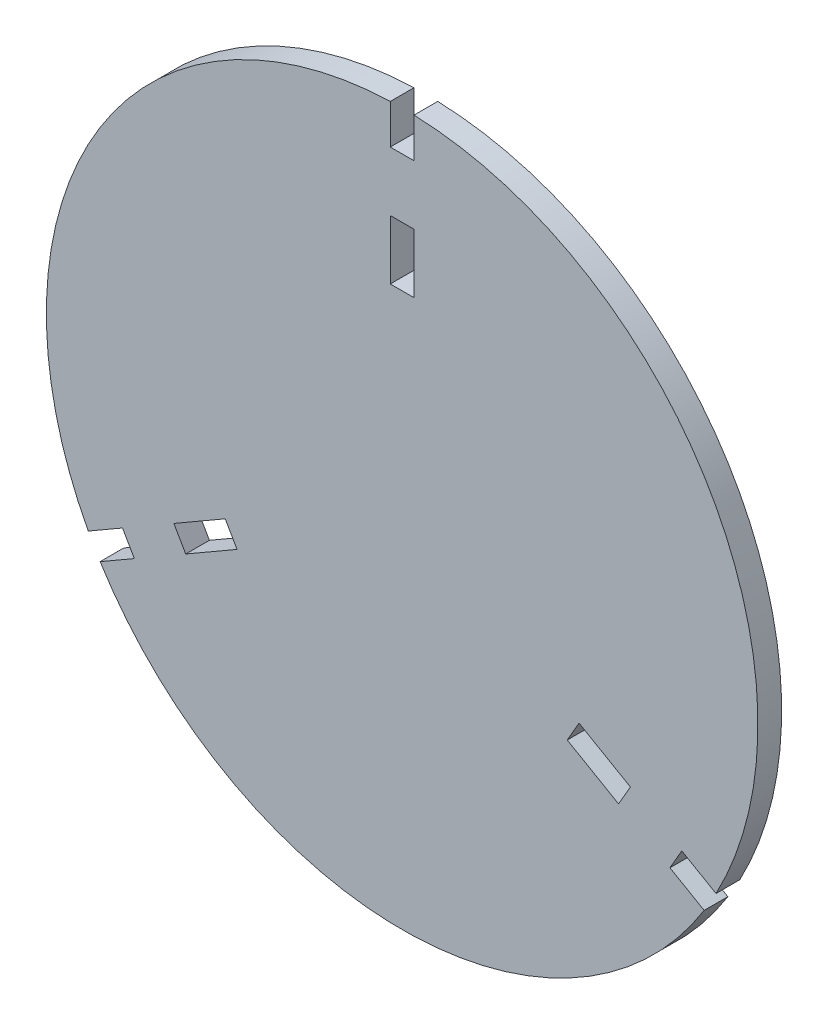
from build123d import *

# Parameters (mm, degrees)
SKETCH1_W           = 12
SKETCH1_H           = 30
BOSS_EXTRUDE1_DEPTH = 12


with BuildPart() as part:
    # Sketch1 → Boss-Extrude1 (new body)
    with BuildSketch(Plane.XY):
        with BuildLine():
            Line((152.797946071, -95.146138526), (135.477437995, -85.146138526))
            Line((135.477437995, -85.146138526), (141.477437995, -74.753833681))
            Line((141.477437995, -74.753833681), (158.797946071, -84.753833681))
            ThreePointArc((158.797946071, -84.753833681), (155.884572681, 90), (6, 179.899972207))
            Line((6, 179.899972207), (6, 159.899972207))
            Line((6, 159.899972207), (-6, 159.899972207))
            Line((-6, 159.899972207), (-6, 179.899972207))
            ThreePointArc((-6, 179.899972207), (-155.884572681, 90), (-158.797946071, -84.753833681))
            Line((-158.797946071, -84.753833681), (-141.477437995, -74.753833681))
            Line((-141.477437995, -74.753833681), (-135.477437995, -85.146138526))
            Line((-135.477437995, -85.146138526), (-152.797946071, -95.146138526))
            ThreePointArc((-152.797946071, -95.146138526), (0, -180), (152.797946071, -95.146138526))
        make_face()
        with Locations((0, 114.899972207)):
            Rectangle(SKETCH1_W, SKETCH1_H, mode=Mode.SUBTRACT)
        Polygon((115.496675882, -59.753833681), (109.496675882, -70.146138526), (83.515913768, -55.146138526), (89.515913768, -44.753833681), align=None, mode=Mode.SUBTRACT)
        Polygon((-109.496675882, -70.146138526), (-115.496675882, -59.753833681), (-89.515913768, -44.753833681), (-83.515913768, -55.146138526), align=None, mode=Mode.SUBTRACT)
    extrude(amount=BOSS_EXTRUDE1_DEPTH)


solid = part.part
